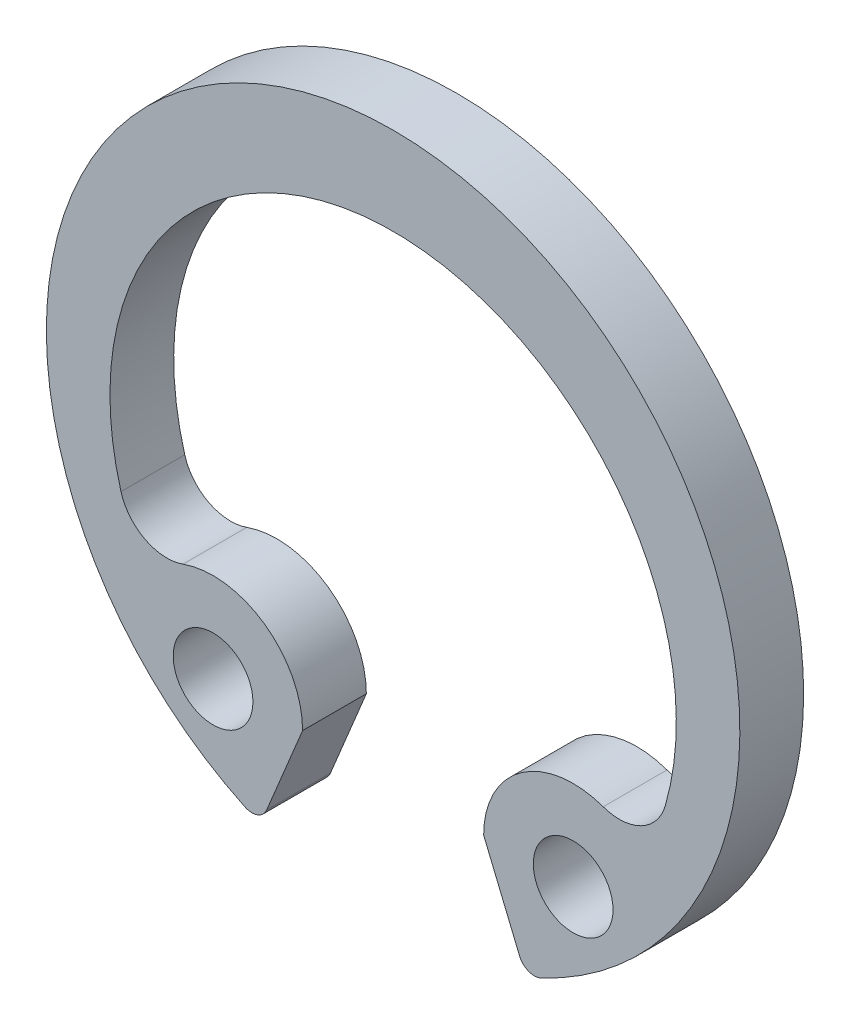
ISO-10303-21;
HEADER;
FILE_DESCRIPTION(('STEP AP214'),'2;1');
FILE_NAME('part.step','',(''),(''),'','','');
FILE_SCHEMA(('AUTOMOTIVE_DESIGN { 1 0 10303 214 1 1 1 1 }'));
ENDSEC;
DATA;
#1=APPLICATION_CONTEXT('core data for automotive mechanical design processes');
#2=APPLICATION_PROTOCOL_DEFINITION('international standard','automotive_design',2000,#1);
#3=PRODUCT_CONTEXT('',#1,'mechanical');
#4=PRODUCT('Part','Part','',(#3));
#5=PRODUCT_RELATED_PRODUCT_CATEGORY('part','',(#4));
#6=PRODUCT_DEFINITION_FORMATION('','',#4);
#7=PRODUCT_DEFINITION_CONTEXT('part definition',#1,'design');
#8=PRODUCT_DEFINITION('design','',#6,#7);
#9=PRODUCT_DEFINITION_SHAPE('','',#8);
#10=(LENGTH_UNIT() NAMED_UNIT(*) SI_UNIT(.MILLI.,.METRE.));
#11=(NAMED_UNIT(*) PLANE_ANGLE_UNIT() SI_UNIT($,.RADIAN.));
#12=(NAMED_UNIT(*) SI_UNIT($,.STERADIAN.) SOLID_ANGLE_UNIT());
#13=UNCERTAINTY_MEASURE_WITH_UNIT(LENGTH_MEASURE(1.E-05),#10,'distance_accuracy_value','');
#14=(GEOMETRIC_REPRESENTATION_CONTEXT(3) GLOBAL_UNCERTAINTY_ASSIGNED_CONTEXT((#13)) GLOBAL_UNIT_ASSIGNED_CONTEXT((#10,
#11,#12)) REPRESENTATION_CONTEXT('',''));
#15=CARTESIAN_POINT('',(0.,0.,0.));
#16=DIRECTION('',(0.,0.,1.));
#17=DIRECTION('',(1.,0.,0.));
#18=AXIS2_PLACEMENT_3D('',#15,#16,#17);
#19=CARTESIAN_POINT('',(-2.25878729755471,-2.7419219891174,0.8));
#20=DIRECTION('',(0.,0.,-1.));
#21=DIRECTION('',(-1.,0.,0.));
#22=AXIS2_PLACEMENT_3D('',#19,#20,#21);
#23=CYLINDRICAL_SURFACE('',#22,1.12304602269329);
#24=CARTESIAN_POINT('',(-2.25878729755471,-2.7419219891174,0.));
#25=DIRECTION('',(0.,0.,1.));
#26=DIRECTION('',(1.,0.,0.));
#27=AXIS2_PLACEMENT_3D('',#24,#25,#26);
#28=CIRCLE('',#27,1.12304602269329);
#29=CARTESIAN_POINT('',(-2.63590012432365,-1.68408538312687,0.));
#30=VERTEX_POINT('',#29);
#31=CARTESIAN_POINT('',(-1.13574127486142,-2.7419219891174,0.));
#32=VERTEX_POINT('',#31);
#33=EDGE_CURVE('E150',#30,#32,#28,.F.);
#34=ORIENTED_EDGE('',*,*,#33,.F.);
#35=DIRECTION('',(0.,0.,-1.));
#36=VECTOR('',#35,1.);
#37=CARTESIAN_POINT('',(-2.63590012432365,-1.68408538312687,0.8));
#38=LINE('',#37,#36);
#39=CARTESIAN_POINT('',(-2.63590012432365,-1.68408538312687,0.8));
#40=VERTEX_POINT('',#39);
#41=EDGE_CURVE('E179',#30,#40,#38,.F.);
#42=ORIENTED_EDGE('',*,*,#41,.T.);
#43=CARTESIAN_POINT('',(-2.25878729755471,-2.7419219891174,0.8));
#44=DIRECTION('',(0.,0.,1.));
#45=DIRECTION('',(1.,0.,0.));
#46=AXIS2_PLACEMENT_3D('',#43,#44,#45);
#47=CIRCLE('',#46,1.12304602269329);
#48=CARTESIAN_POINT('',(-1.13574127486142,-2.7419219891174,0.8));
#49=VERTEX_POINT('',#48);
#50=EDGE_CURVE('E170',#40,#49,#47,.F.);
#51=ORIENTED_EDGE('',*,*,#50,.T.);
#52=DIRECTION('',(0.,0.,-1.));
#53=VECTOR('',#52,1.);
#54=CARTESIAN_POINT('',(-1.13574127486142,-2.7419219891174,0.8));
#55=LINE('',#54,#53);
#56=EDGE_CURVE('E134',#49,#32,#55,.T.);
#57=ORIENTED_EDGE('',*,*,#56,.T.);
#58=EDGE_LOOP('',(#34,#42,#51,#57));
#59=FACE_BOUND('',#58,.T.);
#60=ADVANCED_FACE('F34',(#59),#23,.T.);
#61=CARTESIAN_POINT('',(0.,-0.3025,0.8));
#62=DIRECTION('',(0.,0.,-1.));
#63=DIRECTION('',(-1.,0.,0.));
#64=AXIS2_PLACEMENT_3D('',#61,#62,#63);
#65=CYLINDRICAL_SURFACE('',#64,3.5525);
#66=CARTESIAN_POINT('',(0.,-0.3025,0.));
#67=DIRECTION('',(0.,0.,1.));
#68=DIRECTION('',(1.,0.,0.));
#69=AXIS2_PLACEMENT_3D('',#66,#67,#68);
#70=CIRCLE('',#69,3.5525);
#71=CARTESIAN_POINT('',(-3.41398186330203,-1.2848360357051,0.));
#72=VERTEX_POINT('',#71);
#73=CARTESIAN_POINT('',(3.41398186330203,-1.2848360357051,0.));
#74=VERTEX_POINT('',#73);
#75=EDGE_CURVE('E152',#72,#74,#70,.F.);
#76=ORIENTED_EDGE('',*,*,#75,.T.);
#77=DIRECTION('',(0.,0.,-1.));
#78=VECTOR('',#77,1.);
#79=CARTESIAN_POINT('',(3.41398186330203,-1.2848360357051,0.8));
#80=LINE('',#79,#78);
#81=CARTESIAN_POINT('',(3.41398186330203,-1.2848360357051,0.8));
#82=VERTEX_POINT('',#81);
#83=EDGE_CURVE('E177',#74,#82,#80,.F.);
#84=ORIENTED_EDGE('',*,*,#83,.T.);
#85=CARTESIAN_POINT('',(0.,-0.3025,0.8));
#86=DIRECTION('',(0.,0.,1.));
#87=DIRECTION('',(1.,0.,0.));
#88=AXIS2_PLACEMENT_3D('',#85,#86,#87);
#89=CIRCLE('',#88,3.5525);
#90=CARTESIAN_POINT('',(-3.41398186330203,-1.2848360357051,0.8));
#91=VERTEX_POINT('',#90);
#92=EDGE_CURVE('E125',#91,#82,#89,.F.);
#93=ORIENTED_EDGE('',*,*,#92,.F.);
#94=DIRECTION('',(0.,0.,-1.));
#95=VECTOR('',#94,1.);
#96=CARTESIAN_POINT('',(-3.41398186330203,-1.2848360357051,0.8));
#97=LINE('',#96,#95);
#98=EDGE_CURVE('E174',#91,#72,#97,.T.);
#99=ORIENTED_EDGE('',*,*,#98,.T.);
#100=EDGE_LOOP('',(#76,#84,#93,#99));
#101=FACE_BOUND('',#100,.T.);
#102=ADVANCED_FACE('F227',(#101),#65,.F.);
#103=CARTESIAN_POINT('',(2.25878729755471,-2.7419219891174,0.8));
#104=DIRECTION('',(0.,0.,-1.));
#105=DIRECTION('',(-1.,0.,0.));
#106=AXIS2_PLACEMENT_3D('',#103,#104,#105);
#107=CYLINDRICAL_SURFACE('',#106,1.12304602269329);
#108=CARTESIAN_POINT('',(2.25878729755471,-2.7419219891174,0.8));
#109=DIRECTION('',(0.,0.,1.));
#110=DIRECTION('',(1.,0.,0.));
#111=AXIS2_PLACEMENT_3D('',#108,#109,#110);
#112=CIRCLE('',#111,1.12304602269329);
#113=CARTESIAN_POINT('',(2.63590012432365,-1.68408538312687,0.8));
#114=VERTEX_POINT('',#113);
#115=CARTESIAN_POINT('',(1.13574127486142,-2.7419219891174,0.8));
#116=VERTEX_POINT('',#115);
#117=EDGE_CURVE('E113',#114,#116,#112,.T.);
#118=ORIENTED_EDGE('',*,*,#117,.F.);
#119=DIRECTION('',(0.,0.,-1.));
#120=VECTOR('',#119,1.);
#121=CARTESIAN_POINT('',(2.63590012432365,-1.68408538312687,0.8));
#122=LINE('',#121,#120);
#123=CARTESIAN_POINT('',(2.63590012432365,-1.68408538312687,0.));
#124=VERTEX_POINT('',#123);
#125=EDGE_CURVE('E133',#114,#124,#122,.T.);
#126=ORIENTED_EDGE('',*,*,#125,.T.);
#127=CARTESIAN_POINT('',(2.25878729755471,-2.7419219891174,0.));
#128=DIRECTION('',(0.,0.,1.));
#129=DIRECTION('',(1.,0.,0.));
#130=AXIS2_PLACEMENT_3D('',#127,#128,#129);
#131=CIRCLE('',#130,1.12304602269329);
#132=CARTESIAN_POINT('',(1.13574127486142,-2.7419219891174,0.));
#133=VERTEX_POINT('',#132);
#134=EDGE_CURVE('E131',#124,#133,#131,.T.);
#135=ORIENTED_EDGE('',*,*,#134,.T.);
#136=DIRECTION('',(0.,0.,-1.));
#137=VECTOR('',#136,1.);
#138=CARTESIAN_POINT('',(1.13574127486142,-2.7419219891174,0.8));
#139=LINE('',#138,#137);
#140=EDGE_CURVE('E128',#116,#133,#139,.T.);
#141=ORIENTED_EDGE('',*,*,#140,.F.);
#142=EDGE_LOOP('',(#118,#126,#135,#141));
#143=FACE_BOUND('',#142,.T.);
#144=ADVANCED_FACE('F129',(#143),#107,.T.);
#145=CARTESIAN_POINT('',(0.,0.,0.8));
#146=DIRECTION('',(0.923879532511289,0.382683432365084,0.));
#147=DIRECTION('',(-0.382683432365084,0.923879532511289,0.));
#148=AXIS2_PLACEMENT_3D('',#145,#146,#147);
#149=PLANE('',#148);
#150=DIRECTION('',(0.382683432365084,-0.923879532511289,0.));
#151=VECTOR('',#150,1.);
#152=CARTESIAN_POINT('',(0.,0.,0.));
#153=LINE('',#152,#151);
#154=CARTESIAN_POINT('',(1.58629091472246,-3.82964504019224,0.));
#155=VERTEX_POINT('',#154);
#156=EDGE_CURVE('E156',#133,#155,#153,.T.);
#157=ORIENTED_EDGE('',*,*,#156,.T.);
#158=DIRECTION('',(0.,0.,-1.));
#159=VECTOR('',#158,1.);
#160=CARTESIAN_POINT('',(1.58629091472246,-3.82964504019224,0.8));
#161=LINE('',#160,#159);
#162=CARTESIAN_POINT('',(1.58629091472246,-3.82964504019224,0.8));
#163=VERTEX_POINT('',#162);
#164=EDGE_CURVE('E57',#155,#163,#161,.F.);
#165=ORIENTED_EDGE('',*,*,#164,.T.);
#166=DIRECTION('',(0.382683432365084,-0.923879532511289,0.));
#167=VECTOR('',#166,1.);
#168=CARTESIAN_POINT('',(0.,0.,0.8));
#169=LINE('',#168,#167);
#170=EDGE_CURVE('E117',#116,#163,#169,.T.);
#171=ORIENTED_EDGE('',*,*,#170,.F.);
#172=ORIENTED_EDGE('',*,*,#140,.T.);
#173=EDGE_LOOP('',(#157,#165,#171,#172));
#174=FACE_BOUND('',#173,.T.);
#175=ADVANCED_FACE('F136',(#174),#149,.F.);
#176=CARTESIAN_POINT('',(0.,0.,0.8));
#177=DIRECTION('',(0.,0.,-1.));
#178=DIRECTION('',(-1.,0.,0.));
#179=AXIS2_PLACEMENT_3D('',#176,#177,#178);
#180=CYLINDRICAL_SURFACE('',#179,4.35);
#181=CARTESIAN_POINT('',(0.,0.,0.8));
#182=DIRECTION('',(0.,0.,1.));
#183=DIRECTION('',(1.,0.,0.));
#184=AXIS2_PLACEMENT_3D('',#181,#182,#183);
#185=CIRCLE('',#184,4.35);
#186=CARTESIAN_POINT('',(1.85641943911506,-3.93398104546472,0.8));
#187=VERTEX_POINT('',#186);
#188=CARTESIAN_POINT('',(-1.85641943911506,-3.93398104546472,0.8));
#189=VERTEX_POINT('',#188);
#190=EDGE_CURVE('E137',#187,#189,#185,.T.);
#191=ORIENTED_EDGE('',*,*,#190,.F.);
#192=DIRECTION('',(0.,0.,-1.));
#193=VECTOR('',#192,1.);
#194=CARTESIAN_POINT('',(1.85641943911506,-3.93398104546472,0.8));
#195=LINE('',#194,#193);
#196=CARTESIAN_POINT('',(1.85641943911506,-3.93398104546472,0.));
#197=VERTEX_POINT('',#196);
#198=EDGE_CURVE('E190',#187,#197,#195,.T.);
#199=ORIENTED_EDGE('',*,*,#198,.T.);
#200=CARTESIAN_POINT('',(0.,0.,0.));
#201=DIRECTION('',(0.,0.,1.));
#202=DIRECTION('',(1.,0.,0.));
#203=AXIS2_PLACEMENT_3D('',#200,#201,#202);
#204=CIRCLE('',#203,4.35);
#205=CARTESIAN_POINT('',(-1.85641943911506,-3.93398104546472,0.));
#206=VERTEX_POINT('',#205);
#207=EDGE_CURVE('E158',#197,#206,#204,.T.);
#208=ORIENTED_EDGE('',*,*,#207,.T.);
#209=DIRECTION('',(0.,0.,-1.));
#210=VECTOR('',#209,1.);
#211=CARTESIAN_POINT('',(-1.85641943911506,-3.93398104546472,0.8));
#212=LINE('',#211,#210);
#213=EDGE_CURVE('E188',#206,#189,#212,.F.);
#214=ORIENTED_EDGE('',*,*,#213,.T.);
#215=EDGE_LOOP('',(#191,#199,#208,#214));
#216=FACE_BOUND('',#215,.T.);
#217=ADVANCED_FACE('F202',(#216),#180,.T.);
#218=CARTESIAN_POINT('',(2.25878729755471,-2.7419219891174,0.8));
#219=DIRECTION('',(0.,0.,-1.));
#220=DIRECTION('',(-1.,0.,0.));
#221=AXIS2_PLACEMENT_3D('',#218,#219,#220);
#222=CYLINDRICAL_SURFACE('',#221,0.5);
#223=CARTESIAN_POINT('',(2.25878729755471,-2.7419219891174,0.8));
#224=DIRECTION('',(0.,0.,1.));
#225=DIRECTION('',(1.,0.,0.));
#226=AXIS2_PLACEMENT_3D('',#223,#224,#225);
#227=CIRCLE('',#226,0.5);
#228=CARTESIAN_POINT('',(2.75878729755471,-2.7419219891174,0.8));
#229=VERTEX_POINT('',#228);
#230=EDGE_CURVE('E144',#229,#229,#227,.T.);
#231=ORIENTED_EDGE('',*,*,#230,.T.);
#232=EDGE_LOOP('',(#231));
#233=FACE_BOUND('',#232,.T.);
#234=CARTESIAN_POINT('',(2.25878729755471,-2.7419219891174,0.));
#235=DIRECTION('',(0.,0.,1.));
#236=DIRECTION('',(1.,0.,0.));
#237=AXIS2_PLACEMENT_3D('',#234,#235,#236);
#238=CIRCLE('',#237,0.5);
#239=CARTESIAN_POINT('',(2.75878729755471,-2.7419219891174,0.));
#240=VERTEX_POINT('',#239);
#241=EDGE_CURVE('E164',#240,#240,#238,.T.);
#242=ORIENTED_EDGE('',*,*,#241,.F.);
#243=EDGE_LOOP('',(#242));
#244=FACE_BOUND('',#243,.T.);
#245=ADVANCED_FACE('F252',(#233,#244),#222,.F.);
#246=CARTESIAN_POINT('',(0.,0.,0.8));
#247=DIRECTION('',(0.923879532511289,-0.382683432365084,0.));
#248=DIRECTION('',(0.382683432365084,0.923879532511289,0.));
#249=AXIS2_PLACEMENT_3D('',#246,#247,#248);
#250=PLANE('',#249);
#251=DIRECTION('',(-0.382683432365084,-0.923879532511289,0.));
#252=VECTOR('',#251,1.);
#253=CARTESIAN_POINT('',(0.,0.,0.8));
#254=LINE('',#253,#252);
#255=CARTESIAN_POINT('',(-1.58629091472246,-3.82964504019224,0.8));
#256=VERTEX_POINT('',#255);
#257=EDGE_CURVE('E139',#49,#256,#254,.T.);
#258=ORIENTED_EDGE('',*,*,#257,.T.);
#259=DIRECTION('',(0.,0.,1.));
#260=VECTOR('',#259,1.);
#261=CARTESIAN_POINT('',(-1.58629091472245,-3.82964504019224,0.));
#262=LINE('',#261,#260);
#263=CARTESIAN_POINT('',(-1.58629091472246,-3.82964504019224,0.));
#264=VERTEX_POINT('',#263);
#265=EDGE_CURVE('E11',#256,#264,#262,.F.);
#266=ORIENTED_EDGE('',*,*,#265,.T.);
#267=DIRECTION('',(-0.382683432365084,-0.923879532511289,0.));
#268=VECTOR('',#267,1.);
#269=CARTESIAN_POINT('',(0.,0.,0.));
#270=LINE('',#269,#268);
#271=EDGE_CURVE('E161',#32,#264,#270,.T.);
#272=ORIENTED_EDGE('',*,*,#271,.F.);
#273=ORIENTED_EDGE('',*,*,#56,.F.);
#274=EDGE_LOOP('',(#258,#266,#272,#273));
#275=FACE_BOUND('',#274,.T.);
#276=ADVANCED_FACE('F213',(#275),#250,.T.);
#277=CARTESIAN_POINT('',(-2.25878729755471,-2.7419219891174,0.8));
#278=DIRECTION('',(0.,0.,-1.));
#279=DIRECTION('',(-1.,0.,0.));
#280=AXIS2_PLACEMENT_3D('',#277,#278,#279);
#281=CYLINDRICAL_SURFACE('',#280,0.5);
#282=CARTESIAN_POINT('',(-2.25878729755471,-2.7419219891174,0.8));
#283=DIRECTION('',(0.,0.,1.));
#284=DIRECTION('',(1.,0.,0.));
#285=AXIS2_PLACEMENT_3D('',#282,#283,#284);
#286=CIRCLE('',#285,0.5);
#287=CARTESIAN_POINT('',(-1.75878729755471,-2.7419219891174,0.8));
#288=VERTEX_POINT('',#287);
#289=EDGE_CURVE('E147',#288,#288,#286,.F.);
#290=ORIENTED_EDGE('',*,*,#289,.F.);
#291=EDGE_LOOP('',(#290));
#292=FACE_BOUND('',#291,.T.);
#293=CARTESIAN_POINT('',(-2.25878729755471,-2.7419219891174,0.));
#294=DIRECTION('',(0.,0.,1.));
#295=DIRECTION('',(1.,0.,0.));
#296=AXIS2_PLACEMENT_3D('',#293,#294,#295);
#297=CIRCLE('',#296,0.5);
#298=CARTESIAN_POINT('',(-1.75878729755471,-2.7419219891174,0.));
#299=VERTEX_POINT('',#298);
#300=EDGE_CURVE('E167',#299,#299,#297,.F.);
#301=ORIENTED_EDGE('',*,*,#300,.T.);
#302=EDGE_LOOP('',(#301));
#303=FACE_BOUND('',#302,.T.);
#304=ADVANCED_FACE('F255',(#292,#303),#281,.F.);
#305=CARTESIAN_POINT('',(0.,0.,0.8));
#306=DIRECTION('',(0.,0.,1.));
#307=DIRECTION('',(1.,0.,0.));
#308=AXIS2_PLACEMENT_3D('',#305,#306,#307);
#309=PLANE('',#308);
#310=ORIENTED_EDGE('',*,*,#170,.T.);
#311=CARTESIAN_POINT('',(1.77106682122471,-3.75310835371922,0.8));
#312=DIRECTION('',(0.,0.,1.));
#313=DIRECTION('',(1.,0.,0.));
#314=AXIS2_PLACEMENT_3D('',#311,#312,#313);
#315=CIRCLE('',#314,0.2);
#316=EDGE_CURVE('E42',#163,#187,#315,.T.);
#317=ORIENTED_EDGE('',*,*,#316,.T.);
#318=ORIENTED_EDGE('',*,*,#190,.T.);
#319=CARTESIAN_POINT('',(-1.77106682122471,-3.75310835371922,0.8));
#320=DIRECTION('',(0.,0.,1.));
#321=DIRECTION('',(1.,0.,0.));
#322=AXIS2_PLACEMENT_3D('',#319,#320,#321);
#323=CIRCLE('',#322,0.2);
#324=EDGE_CURVE('E49',#189,#256,#323,.T.);
#325=ORIENTED_EDGE('',*,*,#324,.T.);
#326=ORIENTED_EDGE('',*,*,#257,.F.);
#327=ORIENTED_EDGE('',*,*,#50,.F.);
#328=CARTESIAN_POINT('',(-2.8373769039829,-1.11892424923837,0.8));
#329=DIRECTION('',(0.,0.,1.));
#330=DIRECTION('',(1.,0.,0.));
#331=AXIS2_PLACEMENT_3D('',#328,#329,#330);
#332=CIRCLE('',#331,0.6);
#333=EDGE_CURVE('E186',#40,#91,#332,.F.);
#334=ORIENTED_EDGE('',*,*,#333,.T.);
#335=ORIENTED_EDGE('',*,*,#92,.T.);
#336=CARTESIAN_POINT('',(2.8373769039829,-1.11892424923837,0.8));
#337=DIRECTION('',(0.,0.,1.));
#338=DIRECTION('',(1.,0.,0.));
#339=AXIS2_PLACEMENT_3D('',#336,#337,#338);
#340=CIRCLE('',#339,0.6);
#341=EDGE_CURVE('E121',#82,#114,#340,.F.);
#342=ORIENTED_EDGE('',*,*,#341,.T.);
#343=ORIENTED_EDGE('',*,*,#117,.T.);
#344=EDGE_LOOP('',(#310,#317,#318,#325,#326,#327,#334,#335,#342,#343));
#345=FACE_BOUND('',#344,.T.);
#346=ORIENTED_EDGE('',*,*,#230,.F.);
#347=EDGE_LOOP('',(#346));
#348=FACE_BOUND('',#347,.T.);
#349=ORIENTED_EDGE('',*,*,#289,.T.);
#350=EDGE_LOOP('',(#349));
#351=FACE_BOUND('',#350,.T.);
#352=ADVANCED_FACE('F115',(#345,#348,#351),#309,.T.);
#353=CARTESIAN_POINT('',(0.,0.,0.));
#354=DIRECTION('',(0.,0.,1.));
#355=DIRECTION('',(1.,0.,0.));
#356=AXIS2_PLACEMENT_3D('',#353,#354,#355);
#357=PLANE('',#356);
#358=ORIENTED_EDGE('',*,*,#207,.F.);
#359=CARTESIAN_POINT('',(1.77106682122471,-3.75310835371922,0.));
#360=DIRECTION('',(0.,0.,1.));
#361=DIRECTION('',(1.,0.,0.));
#362=AXIS2_PLACEMENT_3D('',#359,#360,#361);
#363=CIRCLE('',#362,0.2);
#364=EDGE_CURVE('E195',#197,#155,#363,.F.);
#365=ORIENTED_EDGE('',*,*,#364,.T.);
#366=ORIENTED_EDGE('',*,*,#156,.F.);
#367=ORIENTED_EDGE('',*,*,#134,.F.);
#368=CARTESIAN_POINT('',(2.8373769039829,-1.11892424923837,0.));
#369=DIRECTION('',(0.,0.,1.));
#370=DIRECTION('',(1.,0.,0.));
#371=AXIS2_PLACEMENT_3D('',#368,#369,#370);
#372=CIRCLE('',#371,0.6);
#373=EDGE_CURVE('E181',#124,#74,#372,.T.);
#374=ORIENTED_EDGE('',*,*,#373,.T.);
#375=ORIENTED_EDGE('',*,*,#75,.F.);
#376=CARTESIAN_POINT('',(-2.8373769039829,-1.11892424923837,0.));
#377=DIRECTION('',(0.,0.,1.));
#378=DIRECTION('',(1.,0.,0.));
#379=AXIS2_PLACEMENT_3D('',#376,#377,#378);
#380=CIRCLE('',#379,0.6);
#381=EDGE_CURVE('E184',#72,#30,#380,.T.);
#382=ORIENTED_EDGE('',*,*,#381,.T.);
#383=ORIENTED_EDGE('',*,*,#33,.T.);
#384=ORIENTED_EDGE('',*,*,#271,.T.);
#385=CARTESIAN_POINT('',(-1.77106682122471,-3.75310835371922,0.));
#386=DIRECTION('',(0.,0.,1.));
#387=DIRECTION('',(1.,0.,0.));
#388=AXIS2_PLACEMENT_3D('',#385,#386,#387);
#389=CIRCLE('',#388,0.2);
#390=EDGE_CURVE('E193',#264,#206,#389,.F.);
#391=ORIENTED_EDGE('',*,*,#390,.T.);
#392=EDGE_LOOP('',(#358,#365,#366,#367,#374,#375,#382,#383,#384,#391));
#393=FACE_BOUND('',#392,.T.);
#394=ORIENTED_EDGE('',*,*,#241,.T.);
#395=EDGE_LOOP('',(#394));
#396=FACE_BOUND('',#395,.T.);
#397=ORIENTED_EDGE('',*,*,#300,.F.);
#398=EDGE_LOOP('',(#397));
#399=FACE_BOUND('',#398,.T.);
#400=ADVANCED_FACE('F207',(#393,#396,#399),#357,.F.);
#401=CARTESIAN_POINT('',(2.8373769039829,-1.11892424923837,0.8));
#402=DIRECTION('',(0.,0.,-1.));
#403=DIRECTION('',(-1.,0.,0.));
#404=AXIS2_PLACEMENT_3D('',#401,#402,#403);
#405=CYLINDRICAL_SURFACE('',#404,0.6);
#406=ORIENTED_EDGE('',*,*,#341,.F.);
#407=ORIENTED_EDGE('',*,*,#83,.F.);
#408=ORIENTED_EDGE('',*,*,#373,.F.);
#409=ORIENTED_EDGE('',*,*,#125,.F.);
#410=EDGE_LOOP('',(#406,#407,#408,#409));
#411=FACE_BOUND('',#410,.T.);
#412=ADVANCED_FACE('F230',(#411),#405,.F.);
#413=CARTESIAN_POINT('',(-2.8373769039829,-1.11892424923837,0.8));
#414=DIRECTION('',(0.,0.,-1.));
#415=DIRECTION('',(-1.,0.,0.));
#416=AXIS2_PLACEMENT_3D('',#413,#414,#415);
#417=CYLINDRICAL_SURFACE('',#416,0.6);
#418=ORIENTED_EDGE('',*,*,#333,.F.);
#419=ORIENTED_EDGE('',*,*,#41,.F.);
#420=ORIENTED_EDGE('',*,*,#381,.F.);
#421=ORIENTED_EDGE('',*,*,#98,.F.);
#422=EDGE_LOOP('',(#418,#419,#420,#421));
#423=FACE_BOUND('',#422,.T.);
#424=ADVANCED_FACE('F225',(#423),#417,.F.);
#425=CARTESIAN_POINT('',(1.77106682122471,-3.75310835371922,0.8));
#426=DIRECTION('',(0.,0.,-1.));
#427=DIRECTION('',(-1.,0.,0.));
#428=AXIS2_PLACEMENT_3D('',#425,#426,#427);
#429=CYLINDRICAL_SURFACE('',#428,0.2);
#430=ORIENTED_EDGE('',*,*,#316,.F.);
#431=ORIENTED_EDGE('',*,*,#164,.F.);
#432=ORIENTED_EDGE('',*,*,#364,.F.);
#433=ORIENTED_EDGE('',*,*,#198,.F.);
#434=EDGE_LOOP('',(#430,#431,#432,#433));
#435=FACE_BOUND('',#434,.T.);
#436=ADVANCED_FACE('F205',(#435),#429,.T.);
#437=CARTESIAN_POINT('',(-1.77106682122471,-3.75310835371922,0.8));
#438=DIRECTION('',(0.,0.,-1.));
#439=DIRECTION('',(-1.,0.,0.));
#440=AXIS2_PLACEMENT_3D('',#437,#438,#439);
#441=CYLINDRICAL_SURFACE('',#440,0.2);
#442=ORIENTED_EDGE('',*,*,#324,.F.);
#443=ORIENTED_EDGE('',*,*,#213,.F.);
#444=ORIENTED_EDGE('',*,*,#390,.F.);
#445=ORIENTED_EDGE('',*,*,#265,.F.);
#446=EDGE_LOOP('',(#442,#443,#444,#445));
#447=FACE_BOUND('',#446,.T.);
#448=ADVANCED_FACE('F36',(#447),#441,.T.);
#449=CLOSED_SHELL('',(#60,#102,#144,#175,#217,#245,#276,#304,#352,#400,#412,#424,#436,#448));
#450=MANIFOLD_SOLID_BREP('B2',#449);
#451=ADVANCED_BREP_SHAPE_REPRESENTATION('',(#18,#450),#14);
#452=SHAPE_DEFINITION_REPRESENTATION(#9,#451);
ENDSEC;
END-ISO-10303-21;
